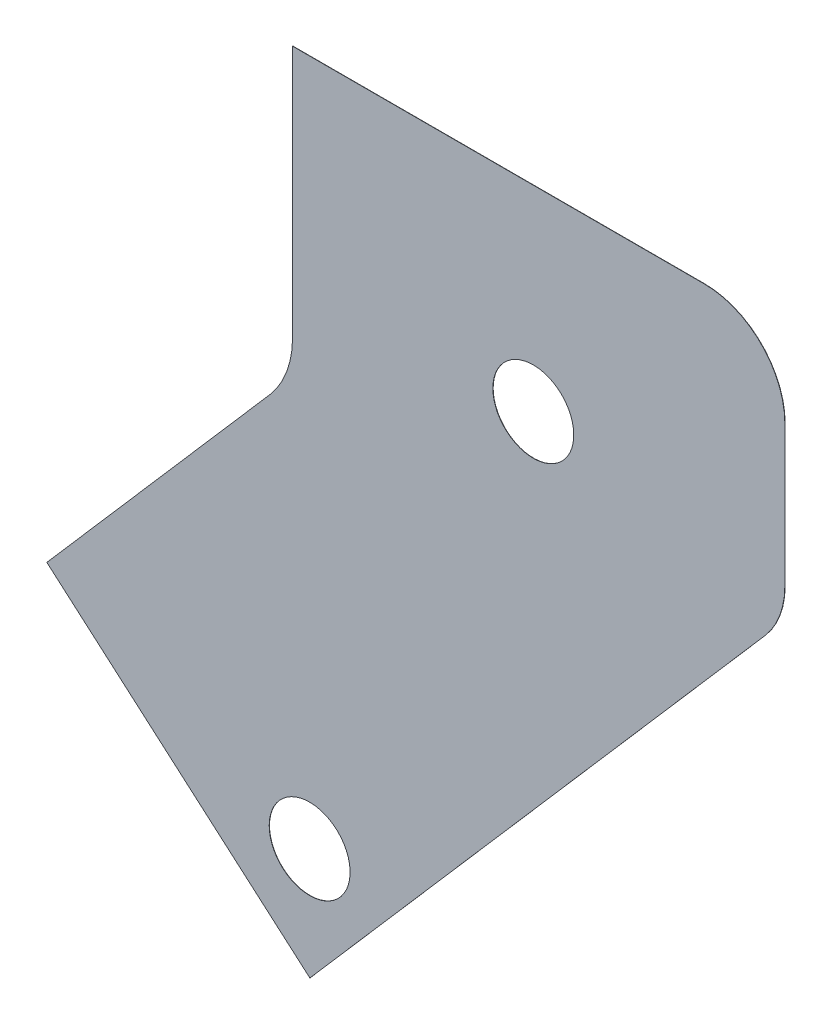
ISO-10303-21;
HEADER;
FILE_DESCRIPTION(('STEP AP214'),'2;1');
FILE_NAME('part.step','',(''),(''),'','','');
FILE_SCHEMA(('AUTOMOTIVE_DESIGN { 1 0 10303 214 1 1 1 1 }'));
ENDSEC;
DATA;
#1=APPLICATION_CONTEXT('core data for automotive mechanical design processes');
#2=APPLICATION_PROTOCOL_DEFINITION('international standard','automotive_design',2000,#1);
#3=PRODUCT_CONTEXT('',#1,'mechanical');
#4=PRODUCT('Part','Part','',(#3));
#5=PRODUCT_RELATED_PRODUCT_CATEGORY('part','',(#4));
#6=PRODUCT_DEFINITION_FORMATION('','',#4);
#7=PRODUCT_DEFINITION_CONTEXT('part definition',#1,'design');
#8=PRODUCT_DEFINITION('design','',#6,#7);
#9=PRODUCT_DEFINITION_SHAPE('','',#8);
#10=(LENGTH_UNIT() NAMED_UNIT(*) SI_UNIT(.MILLI.,.METRE.));
#11=(NAMED_UNIT(*) PLANE_ANGLE_UNIT() SI_UNIT($,.RADIAN.));
#12=(NAMED_UNIT(*) SI_UNIT($,.STERADIAN.) SOLID_ANGLE_UNIT());
#13=UNCERTAINTY_MEASURE_WITH_UNIT(LENGTH_MEASURE(1.E-05),#10,'distance_accuracy_value','');
#14=(GEOMETRIC_REPRESENTATION_CONTEXT(3) GLOBAL_UNCERTAINTY_ASSIGNED_CONTEXT((#13)) GLOBAL_UNIT_ASSIGNED_CONTEXT((#10,
#11,#12)) REPRESENTATION_CONTEXT('',''));
#15=CARTESIAN_POINT('',(0.,0.,0.));
#16=DIRECTION('',(0.,0.,1.));
#17=DIRECTION('',(1.,0.,0.));
#18=AXIS2_PLACEMENT_3D('',#15,#16,#17);
#19=CARTESIAN_POINT('',(-684.744879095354,-63.9886378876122,0.0253999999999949));
#20=DIRECTION('',(0.655690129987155,0.755030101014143,0.));
#21=DIRECTION('',(-0.755030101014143,0.655690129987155,0.));
#22=AXIS2_PLACEMENT_3D('',#19,#20,#21);
#23=PLANE('',#22);
#24=DIRECTION('',(0.755030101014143,-0.655690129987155,0.));
#25=VECTOR('',#24,1.);
#26=CARTESIAN_POINT('',(-684.744879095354,-63.9886378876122,0.));
#27=LINE('',#26,#25);
#28=CARTESIAN_POINT('',(-684.744879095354,-63.9886378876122,0.));
#29=VERTEX_POINT('',#28);
#30=CARTESIAN_POINT('',(-661.539783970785,-84.1406183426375,0.));
#31=VERTEX_POINT('',#30);
#32=EDGE_CURVE('E153',#29,#31,#27,.T.);
#33=ORIENTED_EDGE('',*,*,#32,.T.);
#34=DIRECTION('',(0.,0.,-1.));
#35=VECTOR('',#34,1.);
#36=CARTESIAN_POINT('',(-661.539783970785,-84.1406183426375,0.0253999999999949));
#37=LINE('',#36,#35);
#38=CARTESIAN_POINT('',(-661.539783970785,-84.1406183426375,0.0253999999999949));
#39=VERTEX_POINT('',#38);
#40=EDGE_CURVE('E11',#39,#31,#37,.T.);
#41=ORIENTED_EDGE('',*,*,#40,.F.);
#42=DIRECTION('',(0.755030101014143,-0.655690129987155,0.));
#43=VECTOR('',#42,1.);
#44=CARTESIAN_POINT('',(-684.744879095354,-63.9886378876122,0.0253999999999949));
#45=LINE('',#44,#43);
#46=CARTESIAN_POINT('',(-684.744879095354,-63.9886378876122,0.0253999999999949));
#47=VERTEX_POINT('',#46);
#48=EDGE_CURVE('E179',#47,#39,#45,.T.);
#49=ORIENTED_EDGE('',*,*,#48,.F.);
#50=DIRECTION('',(0.,0.,-1.));
#51=VECTOR('',#50,1.);
#52=CARTESIAN_POINT('',(-684.744879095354,-63.9886378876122,0.0253999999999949));
#53=LINE('',#52,#51);
#54=EDGE_CURVE('E149',#47,#29,#53,.T.);
#55=ORIENTED_EDGE('',*,*,#54,.T.);
#56=EDGE_LOOP('',(#33,#41,#49,#55));
#57=FACE_BOUND('',#56,.T.);
#58=ADVANCED_FACE('F45',(#57),#23,.F.);
#59=CARTESIAN_POINT('',(-661.539783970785,-84.1406183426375,0.0253999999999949));
#60=DIRECTION('',(-0.755030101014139,0.65569012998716,0.));
#61=DIRECTION('',(-0.65569012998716,-0.755030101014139,0.));
#62=AXIS2_PLACEMENT_3D('',#59,#60,#61);
#63=PLANE('',#62);
#64=DIRECTION('',(0.65569012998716,0.755030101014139,0.));
#65=VECTOR('',#64,1.);
#66=CARTESIAN_POINT('',(-661.539783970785,-84.1406183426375,0.));
#67=LINE('',#66,#65);
#68=CARTESIAN_POINT('',(-621.375225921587,-37.8909511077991,0.));
#69=VERTEX_POINT('',#68);
#70=EDGE_CURVE('E157',#31,#69,#67,.T.);
#71=ORIENTED_EDGE('',*,*,#70,.T.);
#72=DIRECTION('',(0.,0.,-1.));
#73=VECTOR('',#72,1.);
#74=CARTESIAN_POINT('',(-621.375225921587,-37.8909511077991,0.0253999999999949));
#75=LINE('',#74,#73);
#76=CARTESIAN_POINT('',(-621.375225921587,-37.8909511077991,0.0253999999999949));
#77=VERTEX_POINT('',#76);
#78=EDGE_CURVE('E54',#77,#69,#75,.T.);
#79=ORIENTED_EDGE('',*,*,#78,.F.);
#80=DIRECTION('',(0.65569012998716,0.755030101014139,0.));
#81=VECTOR('',#80,1.);
#82=CARTESIAN_POINT('',(-661.539783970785,-84.1406183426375,0.0253999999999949));
#83=LINE('',#82,#81);
#84=EDGE_CURVE('E108',#39,#77,#83,.T.);
#85=ORIENTED_EDGE('',*,*,#84,.F.);
#86=ORIENTED_EDGE('',*,*,#40,.T.);
#87=EDGE_LOOP('',(#71,#79,#85,#86));
#88=FACE_BOUND('',#87,.T.);
#89=ADVANCED_FACE('F274',(#88),#63,.F.);
#90=CARTESIAN_POINT('',(-626.745,-33.2276829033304,0.0253999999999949));
#91=DIRECTION('',(0.,0.,-1.));
#92=DIRECTION('',(-1.,0.,0.));
#93=AXIS2_PLACEMENT_3D('',#90,#91,#92);
#94=CYLINDRICAL_SURFACE('',#93,7.112);
#95=CARTESIAN_POINT('',(-626.745,-33.2276829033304,0.));
#96=DIRECTION('',(0.,0.,1.));
#97=DIRECTION('',(1.,0.,0.));
#98=AXIS2_PLACEMENT_3D('',#95,#96,#97);
#99=CIRCLE('',#98,7.112);
#100=CARTESIAN_POINT('',(-619.633,-33.2276829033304,0.));
#101=VERTEX_POINT('',#100);
#102=EDGE_CURVE('E161',#69,#101,#99,.T.);
#103=ORIENTED_EDGE('',*,*,#102,.T.);
#104=DIRECTION('',(0.,0.,-1.));
#105=VECTOR('',#104,1.);
#106=CARTESIAN_POINT('',(-619.633,-33.2276829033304,0.0253999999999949));
#107=LINE('',#106,#105);
#108=CARTESIAN_POINT('',(-619.633,-33.2276829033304,0.0253999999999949));
#109=VERTEX_POINT('',#108);
#110=EDGE_CURVE('E194',#109,#101,#107,.T.);
#111=ORIENTED_EDGE('',*,*,#110,.F.);
#112=CARTESIAN_POINT('',(-626.745,-33.2276829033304,0.0253999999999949));
#113=DIRECTION('',(0.,0.,1.));
#114=DIRECTION('',(1.,0.,0.));
#115=AXIS2_PLACEMENT_3D('',#112,#113,#114);
#116=CIRCLE('',#115,7.112);
#117=EDGE_CURVE('E205',#77,#109,#116,.T.);
#118=ORIENTED_EDGE('',*,*,#117,.F.);
#119=ORIENTED_EDGE('',*,*,#78,.T.);
#120=EDGE_LOOP('',(#103,#111,#118,#119));
#121=FACE_BOUND('',#120,.T.);
#122=ADVANCED_FACE('F203',(#121),#94,.T.);
#123=CARTESIAN_POINT('',(-619.633,-33.2276829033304,0.0253999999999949));
#124=DIRECTION('',(-1.,0.,0.));
#125=DIRECTION('',(0.,0.,1.));
#126=AXIS2_PLACEMENT_3D('',#123,#124,#125);
#127=PLANE('',#126);
#128=DIRECTION('',(0.,1.,0.));
#129=VECTOR('',#128,1.);
#130=CARTESIAN_POINT('',(-619.633,-33.2276829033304,0.));
#131=LINE('',#130,#129);
#132=CARTESIAN_POINT('',(-619.633,-20.8198728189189,0.));
#133=VERTEX_POINT('',#132);
#134=EDGE_CURVE('E164',#101,#133,#131,.T.);
#135=ORIENTED_EDGE('',*,*,#134,.T.);
#136=DIRECTION('',(0.,0.,-1.));
#137=VECTOR('',#136,1.);
#138=CARTESIAN_POINT('',(-619.633,-20.8198728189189,0.0253999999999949));
#139=LINE('',#138,#137);
#140=CARTESIAN_POINT('',(-619.633,-20.8198728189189,0.0253999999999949));
#141=VERTEX_POINT('',#140);
#142=EDGE_CURVE('E190',#141,#133,#139,.T.);
#143=ORIENTED_EDGE('',*,*,#142,.F.);
#144=DIRECTION('',(0.,1.,0.));
#145=VECTOR('',#144,1.);
#146=CARTESIAN_POINT('',(-619.633,-33.2276829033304,0.0253999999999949));
#147=LINE('',#146,#145);
#148=EDGE_CURVE('E222',#109,#141,#147,.T.);
#149=ORIENTED_EDGE('',*,*,#148,.F.);
#150=ORIENTED_EDGE('',*,*,#110,.T.);
#151=EDGE_LOOP('',(#135,#143,#149,#150));
#152=FACE_BOUND('',#151,.T.);
#153=ADVANCED_FACE('F214',(#152),#127,.F.);
#154=CARTESIAN_POINT('',(-626.745,-20.8198728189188,0.0253999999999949));
#155=DIRECTION('',(0.,0.,-1.));
#156=DIRECTION('',(-1.,0.,0.));
#157=AXIS2_PLACEMENT_3D('',#154,#155,#156);
#158=CYLINDRICAL_SURFACE('',#157,7.11199999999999);
#159=CARTESIAN_POINT('',(-626.745,-20.8198728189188,0.));
#160=DIRECTION('',(0.,0.,1.));
#161=DIRECTION('',(1.,0.,0.));
#162=AXIS2_PLACEMENT_3D('',#159,#160,#161);
#163=CIRCLE('',#162,7.11199999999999);
#164=CARTESIAN_POINT('',(-626.745,-13.7078728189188,0.));
#165=VERTEX_POINT('',#164);
#166=EDGE_CURVE('E167',#133,#165,#163,.T.);
#167=ORIENTED_EDGE('',*,*,#166,.T.);
#168=DIRECTION('',(0.,0.,-1.));
#169=VECTOR('',#168,1.);
#170=CARTESIAN_POINT('',(-626.745,-13.7078728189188,0.0253999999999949));
#171=LINE('',#170,#169);
#172=CARTESIAN_POINT('',(-626.745,-13.7078728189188,0.0253999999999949));
#173=VERTEX_POINT('',#172);
#174=EDGE_CURVE('E186',#173,#165,#171,.T.);
#175=ORIENTED_EDGE('',*,*,#174,.F.);
#176=CARTESIAN_POINT('',(-626.745,-20.8198728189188,0.0253999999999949));
#177=DIRECTION('',(0.,0.,1.));
#178=DIRECTION('',(1.,0.,0.));
#179=AXIS2_PLACEMENT_3D('',#176,#177,#178);
#180=CIRCLE('',#179,7.11199999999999);
#181=EDGE_CURVE('E220',#141,#173,#180,.T.);
#182=ORIENTED_EDGE('',*,*,#181,.F.);
#183=ORIENTED_EDGE('',*,*,#142,.T.);
#184=EDGE_LOOP('',(#167,#175,#182,#183));
#185=FACE_BOUND('',#184,.T.);
#186=ADVANCED_FACE('F218',(#185),#158,.T.);
#187=CARTESIAN_POINT('',(-626.745,-13.7078728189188,0.0253999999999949));
#188=DIRECTION('',(0.,-1.,0.));
#189=DIRECTION('',(1.,0.,0.));
#190=AXIS2_PLACEMENT_3D('',#187,#188,#189);
#191=PLANE('',#190);
#192=DIRECTION('',(-1.,0.,0.));
#193=VECTOR('',#192,1.);
#194=CARTESIAN_POINT('',(-626.745,-13.7078728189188,0.));
#195=LINE('',#194,#193);
#196=CARTESIAN_POINT('',(-663.067,-13.7078728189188,0.));
#197=VERTEX_POINT('',#196);
#198=EDGE_CURVE('E170',#165,#197,#195,.T.);
#199=ORIENTED_EDGE('',*,*,#198,.T.);
#200=DIRECTION('',(0.,0.,-1.));
#201=VECTOR('',#200,1.);
#202=CARTESIAN_POINT('',(-663.067,-13.7078728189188,0.0253999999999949));
#203=LINE('',#202,#201);
#204=CARTESIAN_POINT('',(-663.067,-13.7078728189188,0.0253999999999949));
#205=VERTEX_POINT('',#204);
#206=EDGE_CURVE('E141',#205,#197,#203,.T.);
#207=ORIENTED_EDGE('',*,*,#206,.F.);
#208=DIRECTION('',(-1.,0.,0.));
#209=VECTOR('',#208,1.);
#210=CARTESIAN_POINT('',(-626.745,-13.7078728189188,0.0253999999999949));
#211=LINE('',#210,#209);
#212=EDGE_CURVE('E130',#173,#205,#211,.T.);
#213=ORIENTED_EDGE('',*,*,#212,.F.);
#214=ORIENTED_EDGE('',*,*,#174,.T.);
#215=EDGE_LOOP('',(#199,#207,#213,#214));
#216=FACE_BOUND('',#215,.T.);
#217=ADVANCED_FACE('F282',(#216),#191,.F.);
#218=CARTESIAN_POINT('',(-663.067,-13.7078728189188,0.0253999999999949));
#219=DIRECTION('',(1.,0.,0.));
#220=DIRECTION('',(0.,1.,0.));
#221=AXIS2_PLACEMENT_3D('',#218,#219,#220);
#222=PLANE('',#221);
#223=DIRECTION('',(0.,-1.,0.));
#224=VECTOR('',#223,1.);
#225=CARTESIAN_POINT('',(-663.067,-13.7078728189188,0.));
#226=LINE('',#225,#224);
#227=CARTESIAN_POINT('',(-663.067,-35.989792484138,0.));
#228=VERTEX_POINT('',#227);
#229=EDGE_CURVE('E139',#197,#228,#226,.T.);
#230=ORIENTED_EDGE('',*,*,#229,.T.);
#231=DIRECTION('',(0.,0.,-1.));
#232=VECTOR('',#231,1.);
#233=CARTESIAN_POINT('',(-663.067,-35.989792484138,0.0253999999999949));
#234=LINE('',#233,#232);
#235=CARTESIAN_POINT('',(-663.067,-35.989792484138,0.0253999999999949));
#236=VERTEX_POINT('',#235);
#237=EDGE_CURVE('E136',#236,#228,#234,.T.);
#238=ORIENTED_EDGE('',*,*,#237,.F.);
#239=DIRECTION('',(0.,-1.,0.));
#240=VECTOR('',#239,1.);
#241=CARTESIAN_POINT('',(-663.067,-13.7078728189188,0.0253999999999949));
#242=LINE('',#241,#240);
#243=EDGE_CURVE('E124',#205,#236,#242,.T.);
#244=ORIENTED_EDGE('',*,*,#243,.F.);
#245=ORIENTED_EDGE('',*,*,#206,.T.);
#246=EDGE_LOOP('',(#230,#238,#244,#245));
#247=FACE_BOUND('',#246,.T.);
#248=ADVANCED_FACE('F137',(#247),#222,.F.);
#249=CARTESIAN_POINT('',(-671.195,-35.989792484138,0.0253999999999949));
#250=DIRECTION('',(0.,0.,-1.));
#251=DIRECTION('',(-1.,0.,0.));
#252=AXIS2_PLACEMENT_3D('',#249,#250,#251);
#253=CYLINDRICAL_SURFACE('',#252,8.12799999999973);
#254=CARTESIAN_POINT('',(-671.195,-35.989792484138,0.));
#255=DIRECTION('',(0.,0.,-1.));
#256=DIRECTION('',(1.,0.,0.));
#257=AXIS2_PLACEMENT_3D('',#254,#255,#256);
#258=CIRCLE('',#257,8.12799999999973);
#259=CARTESIAN_POINT('',(-665.058115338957,-41.3192418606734,0.));
#260=VERTEX_POINT('',#259);
#261=EDGE_CURVE('E94',#228,#260,#258,.T.);
#262=ORIENTED_EDGE('',*,*,#261,.T.);
#263=DIRECTION('',(0.,0.,-1.));
#264=VECTOR('',#263,1.);
#265=CARTESIAN_POINT('',(-665.058115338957,-41.3192418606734,0.0253999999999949));
#266=LINE('',#265,#264);
#267=CARTESIAN_POINT('',(-665.058115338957,-41.3192418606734,0.0253999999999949));
#268=VERTEX_POINT('',#267);
#269=EDGE_CURVE('E142',#268,#260,#266,.T.);
#270=ORIENTED_EDGE('',*,*,#269,.F.);
#271=CARTESIAN_POINT('',(-671.195,-35.989792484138,0.0253999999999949));
#272=DIRECTION('',(0.,0.,-1.));
#273=DIRECTION('',(1.,0.,0.));
#274=AXIS2_PLACEMENT_3D('',#271,#272,#273);
#275=CIRCLE('',#274,8.12799999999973);
#276=EDGE_CURVE('E128',#236,#268,#275,.T.);
#277=ORIENTED_EDGE('',*,*,#276,.F.);
#278=ORIENTED_EDGE('',*,*,#237,.T.);
#279=EDGE_LOOP('',(#262,#270,#277,#278));
#280=FACE_BOUND('',#279,.T.);
#281=ADVANCED_FACE('F144',(#280),#253,.F.);
#282=CARTESIAN_POINT('',(-665.058115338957,-41.3192418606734,0.0253999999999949));
#283=DIRECTION('',(0.755030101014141,-0.655690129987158,0.));
#284=DIRECTION('',(0.655690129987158,0.755030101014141,0.));
#285=AXIS2_PLACEMENT_3D('',#282,#283,#284);
#286=PLANE('',#285);
#287=DIRECTION('',(-0.655690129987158,-0.755030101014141,0.));
#288=VECTOR('',#287,1.);
#289=CARTESIAN_POINT('',(-665.058115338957,-41.3192418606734,0.));
#290=LINE('',#289,#288);
#291=EDGE_CURVE('E100',#260,#29,#290,.T.);
#292=ORIENTED_EDGE('',*,*,#291,.T.);
#293=ORIENTED_EDGE('',*,*,#54,.F.);
#294=DIRECTION('',(-0.655690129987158,-0.755030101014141,0.));
#295=VECTOR('',#294,1.);
#296=CARTESIAN_POINT('',(-665.058115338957,-41.3192418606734,0.0253999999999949));
#297=LINE('',#296,#295);
#298=EDGE_CURVE('E62',#268,#47,#297,.T.);
#299=ORIENTED_EDGE('',*,*,#298,.F.);
#300=ORIENTED_EDGE('',*,*,#269,.T.);
#301=EDGE_LOOP('',(#292,#293,#299,#300));
#302=FACE_BOUND('',#301,.T.);
#303=ADVANCED_FACE('F330',(#302),#286,.F.);
#304=CARTESIAN_POINT('',(-626.745,-33.2276829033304,0.0253999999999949));
#305=DIRECTION('',(0.,0.,1.));
#306=DIRECTION('',(1.,0.,0.));
#307=AXIS2_PLACEMENT_3D('',#304,#305,#306);
#308=PLANE('',#307);
#309=CARTESIAN_POINT('',(-641.825795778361,-31.0085922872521,0.0253999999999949));
#310=DIRECTION('',(0.,0.,-1.));
#311=DIRECTION('',(-1.,0.,0.));
#312=AXIS2_PLACEMENT_3D('',#309,#310,#311);
#313=CIRCLE('',#312,3.56869999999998);
#314=CARTESIAN_POINT('',(-645.39449577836,-31.0085922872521,0.0253999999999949));
#315=VERTEX_POINT('',#314);
#316=EDGE_CURVE('E246',#315,#315,#313,.T.);
#317=ORIENTED_EDGE('',*,*,#316,.T.);
#318=EDGE_LOOP('',(#317));
#319=FACE_BOUND('',#318,.T.);
#320=CARTESIAN_POINT('',(-661.55866411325,-74.2842172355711,0.0253999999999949));
#321=DIRECTION('',(0.,0.,-1.));
#322=DIRECTION('',(-1.,0.,0.));
#323=AXIS2_PLACEMENT_3D('',#320,#321,#322);
#324=CIRCLE('',#323,3.56869999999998);
#325=CARTESIAN_POINT('',(-665.12736411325,-74.2842172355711,0.0253999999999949));
#326=VERTEX_POINT('',#325);
#327=EDGE_CURVE('E238',#326,#326,#324,.T.);
#328=ORIENTED_EDGE('',*,*,#327,.T.);
#329=EDGE_LOOP('',(#328));
#330=FACE_BOUND('',#329,.T.);
#331=ORIENTED_EDGE('',*,*,#48,.T.);
#332=ORIENTED_EDGE('',*,*,#84,.T.);
#333=ORIENTED_EDGE('',*,*,#117,.T.);
#334=ORIENTED_EDGE('',*,*,#148,.T.);
#335=ORIENTED_EDGE('',*,*,#181,.T.);
#336=ORIENTED_EDGE('',*,*,#212,.T.);
#337=ORIENTED_EDGE('',*,*,#243,.T.);
#338=ORIENTED_EDGE('',*,*,#276,.T.);
#339=ORIENTED_EDGE('',*,*,#298,.T.);
#340=EDGE_LOOP('',(#331,#332,#333,#334,#335,#336,#337,#338,#339));
#341=FACE_BOUND('',#340,.T.);
#342=ADVANCED_FACE('F126',(#319,#330,#341),#308,.T.);
#343=CARTESIAN_POINT('',(-626.745,-33.2276829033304,0.));
#344=DIRECTION('',(0.,0.,1.));
#345=DIRECTION('',(1.,0.,0.));
#346=AXIS2_PLACEMENT_3D('',#343,#344,#345);
#347=PLANE('',#346);
#348=CARTESIAN_POINT('',(-641.825795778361,-31.0085922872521,0.));
#349=DIRECTION('',(0.,0.,-1.));
#350=DIRECTION('',(-1.,0.,0.));
#351=AXIS2_PLACEMENT_3D('',#348,#349,#350);
#352=CIRCLE('',#351,3.56869999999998);
#353=CARTESIAN_POINT('',(-645.39449577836,-31.0085922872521,0.));
#354=VERTEX_POINT('',#353);
#355=EDGE_CURVE('E242',#354,#354,#352,.T.);
#356=ORIENTED_EDGE('',*,*,#355,.F.);
#357=EDGE_LOOP('',(#356));
#358=FACE_BOUND('',#357,.T.);
#359=CARTESIAN_POINT('',(-661.55866411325,-74.2842172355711,0.));
#360=DIRECTION('',(0.,0.,-1.));
#361=DIRECTION('',(-1.,0.,0.));
#362=AXIS2_PLACEMENT_3D('',#359,#360,#361);
#363=CIRCLE('',#362,3.56869999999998);
#364=CARTESIAN_POINT('',(-665.12736411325,-74.2842172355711,0.));
#365=VERTEX_POINT('',#364);
#366=EDGE_CURVE('E158',#365,#365,#363,.T.);
#367=ORIENTED_EDGE('',*,*,#366,.F.);
#368=EDGE_LOOP('',(#367));
#369=FACE_BOUND('',#368,.T.);
#370=ORIENTED_EDGE('',*,*,#32,.F.);
#371=ORIENTED_EDGE('',*,*,#291,.F.);
#372=ORIENTED_EDGE('',*,*,#261,.F.);
#373=ORIENTED_EDGE('',*,*,#229,.F.);
#374=ORIENTED_EDGE('',*,*,#198,.F.);
#375=ORIENTED_EDGE('',*,*,#166,.F.);
#376=ORIENTED_EDGE('',*,*,#134,.F.);
#377=ORIENTED_EDGE('',*,*,#102,.F.);
#378=ORIENTED_EDGE('',*,*,#70,.F.);
#379=EDGE_LOOP('',(#370,#371,#372,#373,#374,#375,#376,#377,#378));
#380=FACE_BOUND('',#379,.T.);
#381=ADVANCED_FACE('F209',(#358,#369,#380),#347,.F.);
#382=CARTESIAN_POINT('',(-661.55866411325,-74.2842172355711,0.));
#383=DIRECTION('',(0.,0.,-1.));
#384=DIRECTION('',(-1.,0.,0.));
#385=AXIS2_PLACEMENT_3D('',#382,#383,#384);
#386=CYLINDRICAL_SURFACE('',#385,3.56869999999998);
#387=ORIENTED_EDGE('',*,*,#327,.F.);
#388=EDGE_LOOP('',(#387));
#389=FACE_BOUND('',#388,.T.);
#390=ORIENTED_EDGE('',*,*,#366,.T.);
#391=EDGE_LOOP('',(#390));
#392=FACE_BOUND('',#391,.T.);
#393=ADVANCED_FACE('F257',(#389,#392),#386,.F.);
#394=CARTESIAN_POINT('',(-641.825795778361,-31.0085922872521,0.));
#395=DIRECTION('',(0.,0.,-1.));
#396=DIRECTION('',(-1.,0.,0.));
#397=AXIS2_PLACEMENT_3D('',#394,#395,#396);
#398=CYLINDRICAL_SURFACE('',#397,3.56869999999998);
#399=ORIENTED_EDGE('',*,*,#316,.F.);
#400=EDGE_LOOP('',(#399));
#401=FACE_BOUND('',#400,.T.);
#402=ORIENTED_EDGE('',*,*,#355,.T.);
#403=EDGE_LOOP('',(#402));
#404=FACE_BOUND('',#403,.T.);
#405=ADVANCED_FACE('F254',(#401,#404),#398,.F.);
#406=CLOSED_SHELL('',(#58,#89,#122,#153,#186,#217,#248,#281,#303,#342,#381,#393,#405));
#407=MANIFOLD_SOLID_BREP('B2',#406);
#408=ADVANCED_BREP_SHAPE_REPRESENTATION('',(#18,#407),#14);
#409=SHAPE_DEFINITION_REPRESENTATION(#9,#408);
ENDSEC;
END-ISO-10303-21;
